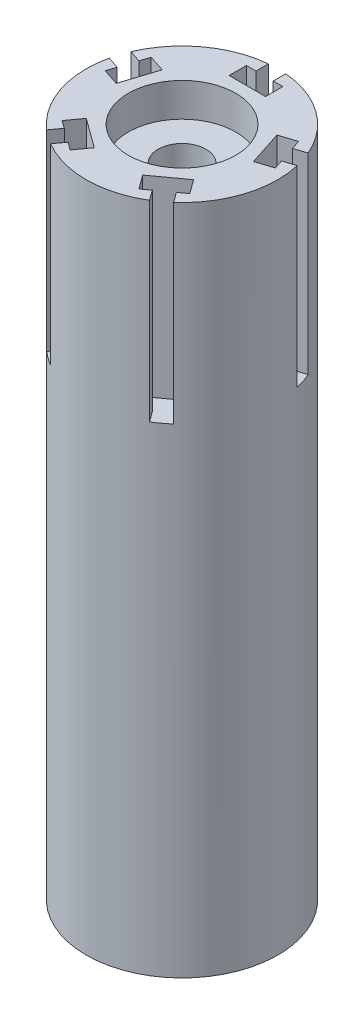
ISO-10303-21;
HEADER;
FILE_DESCRIPTION(('STEP AP214'),'2;1');
FILE_NAME('part.step','',(''),(''),'','','');
FILE_SCHEMA(('AUTOMOTIVE_DESIGN { 1 0 10303 214 1 1 1 1 }'));
ENDSEC;
DATA;
#1=APPLICATION_CONTEXT('core data for automotive mechanical design processes');
#2=APPLICATION_PROTOCOL_DEFINITION('international standard','automotive_design',2000,#1);
#3=PRODUCT_CONTEXT('',#1,'mechanical');
#4=PRODUCT('Part','Part','',(#3));
#5=PRODUCT_RELATED_PRODUCT_CATEGORY('part','',(#4));
#6=PRODUCT_DEFINITION_FORMATION('','',#4);
#7=PRODUCT_DEFINITION_CONTEXT('part definition',#1,'design');
#8=PRODUCT_DEFINITION('design','',#6,#7);
#9=PRODUCT_DEFINITION_SHAPE('','',#8);
#10=(LENGTH_UNIT() NAMED_UNIT(*) SI_UNIT(.MILLI.,.METRE.));
#11=(NAMED_UNIT(*) PLANE_ANGLE_UNIT() SI_UNIT($,.RADIAN.));
#12=(NAMED_UNIT(*) SI_UNIT($,.STERADIAN.) SOLID_ANGLE_UNIT());
#13=UNCERTAINTY_MEASURE_WITH_UNIT(LENGTH_MEASURE(1.E-05),#10,'distance_accuracy_value','');
#14=(GEOMETRIC_REPRESENTATION_CONTEXT(3) GLOBAL_UNCERTAINTY_ASSIGNED_CONTEXT((#13)) GLOBAL_UNIT_ASSIGNED_CONTEXT((#10,
#11,#12)) REPRESENTATION_CONTEXT('',''));
#15=CARTESIAN_POINT('',(0.,0.,0.));
#16=DIRECTION('',(0.,0.,1.));
#17=DIRECTION('',(1.,0.,0.));
#18=AXIS2_PLACEMENT_3D('',#15,#16,#17);
#19=CARTESIAN_POINT('',(0.,140.,0.));
#20=DIRECTION('',(0.,-1.,0.));
#21=DIRECTION('',(0.,0.,-1.));
#22=AXIS2_PLACEMENT_3D('',#19,#20,#21);
#23=CYLINDRICAL_SURFACE('',#22,5.);
#24=CARTESIAN_POINT('',(0.,7.00000000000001,0.));
#25=DIRECTION('',(0.,-1.,0.));
#26=DIRECTION('',(0.,0.,-1.));
#27=AXIS2_PLACEMENT_3D('',#24,#25,#26);
#28=CIRCLE('',#27,5.);
#29=CARTESIAN_POINT('',(0.,7.00000000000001,-5.));
#30=VERTEX_POINT('',#29);
#31=EDGE_CURVE('E575',#30,#30,#28,.T.);
#32=ORIENTED_EDGE('',*,*,#31,.T.);
#33=EDGE_LOOP('',(#32));
#34=FACE_BOUND('',#33,.T.);
#35=CARTESIAN_POINT('',(0.,133.,0.));
#36=DIRECTION('',(0.,1.,0.));
#37=DIRECTION('',(0.,0.,1.));
#38=AXIS2_PLACEMENT_3D('',#35,#36,#37);
#39=CIRCLE('',#38,5.);
#40=CARTESIAN_POINT('',(0.,133.,5.));
#41=VERTEX_POINT('',#40);
#42=EDGE_CURVE('E37',#41,#41,#39,.F.);
#43=ORIENTED_EDGE('',*,*,#42,.F.);
#44=EDGE_LOOP('',(#43));
#45=FACE_BOUND('',#44,.T.);
#46=ADVANCED_FACE('F33',(#34,#45),#23,.F.);
#47=CARTESIAN_POINT('',(0.,140.,0.));
#48=DIRECTION('',(0.,-1.,0.));
#49=DIRECTION('',(0.,0.,-1.));
#50=AXIS2_PLACEMENT_3D('',#47,#48,#49);
#51=CYLINDRICAL_SURFACE('',#50,20.);
#52=CARTESIAN_POINT('',(0.,100.,0.));
#53=DIRECTION('',(0.,1.,0.));
#54=DIRECTION('',(0.587785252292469,0.,-0.809016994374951));
#55=AXIS2_PLACEMENT_3D('',#52,#53,#54);
#56=CIRCLE('',#55,20.);
#57=CARTESIAN_POINT('',(-13.0884894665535,100.,15.1225475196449));
#58=VERTEX_POINT('',#57);
#59=CARTESIAN_POINT('',(-10.1654049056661,100.,17.2239525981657));
#60=VERTEX_POINT('',#59);
#61=EDGE_CURVE('E306',#58,#60,#56,.T.);
#62=ORIENTED_EDGE('',*,*,#61,.F.);
#63=DIRECTION('',(0.,1.,0.));
#64=VECTOR('',#63,1.);
#65=CARTESIAN_POINT('',(-13.0884894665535,100.,15.1225475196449));
#66=LINE('',#65,#64);
#67=CARTESIAN_POINT('',(-13.0884894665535,140.,15.1225475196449));
#68=VERTEX_POINT('',#67);
#69=EDGE_CURVE('E479',#58,#68,#66,.T.);
#70=ORIENTED_EDGE('',*,*,#69,.T.);
#71=CARTESIAN_POINT('',(0.,140.,0.));
#72=DIRECTION('',(0.,1.,0.));
#73=DIRECTION('',(0.,0.,1.));
#74=AXIS2_PLACEMENT_3D('',#71,#72,#73);
#75=CIRCLE('',#74,20.);
#76=CARTESIAN_POINT('',(-19.5222352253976,140.,-4.34538051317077));
#77=VERTEX_POINT('',#76);
#78=EDGE_CURVE('E42',#77,#68,#75,.T.);
#79=ORIENTED_EDGE('',*,*,#78,.F.);
#80=DIRECTION('',(0.,1.,0.));
#81=VECTOR('',#80,1.);
#82=CARTESIAN_POINT('',(-19.5222352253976,100.,-4.34538051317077));
#83=LINE('',#82,#81);
#84=CARTESIAN_POINT('',(-19.5222352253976,100.,-4.34538051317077));
#85=VERTEX_POINT('',#84);
#86=EDGE_CURVE('E474',#85,#77,#83,.T.);
#87=ORIENTED_EDGE('',*,*,#86,.F.);
#88=CARTESIAN_POINT('',(0.,100.,0.));
#89=DIRECTION('',(0.,1.,0.));
#90=DIRECTION('',(0.951056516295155,0.,0.309016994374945));
#91=AXIS2_PLACEMENT_3D('',#88,#89,#90);
#92=CIRCLE('',#91,20.);
#93=CARTESIAN_POINT('',(-18.4269630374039,100.,-7.77476901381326));
#94=VERTEX_POINT('',#93);
#95=EDGE_CURVE('E449',#94,#85,#92,.T.);
#96=ORIENTED_EDGE('',*,*,#95,.F.);
#97=DIRECTION('',(0.,1.,0.));
#98=VECTOR('',#97,1.);
#99=CARTESIAN_POINT('',(-18.4269630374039,100.,-7.77476901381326));
#100=LINE('',#99,#98);
#101=CARTESIAN_POINT('',(-18.4269630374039,140.,-7.77476901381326));
#102=VERTEX_POINT('',#101);
#103=EDGE_CURVE('E495',#94,#102,#100,.T.);
#104=ORIENTED_EDGE('',*,*,#103,.T.);
#105=CARTESIAN_POINT('',(-1.9,140.,-19.9095454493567));
#106=VERTEX_POINT('',#105);
#107=EDGE_CURVE('E11',#106,#102,#75,.T.);
#108=ORIENTED_EDGE('',*,*,#107,.F.);
#109=DIRECTION('',(0.,1.,0.));
#110=VECTOR('',#109,1.);
#111=CARTESIAN_POINT('',(-1.9,100.,-19.9095454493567));
#112=LINE('',#111,#110);
#113=CARTESIAN_POINT('',(-1.9,100.,-19.9095454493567));
#114=VERTEX_POINT('',#113);
#115=EDGE_CURVE('E537',#114,#106,#112,.T.);
#116=ORIENTED_EDGE('',*,*,#115,.F.);
#117=CARTESIAN_POINT('',(0.,100.,0.));
#118=DIRECTION('',(0.,1.,0.));
#119=DIRECTION('',(0.,0.,1.));
#120=AXIS2_PLACEMENT_3D('',#117,#118,#119);
#121=CIRCLE('',#120,20.);
#122=CARTESIAN_POINT('',(1.7,100.,-19.9276190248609));
#123=VERTEX_POINT('',#122);
#124=EDGE_CURVE('E512',#123,#114,#121,.T.);
#125=ORIENTED_EDGE('',*,*,#124,.F.);
#126=DIRECTION('',(0.,1.,0.));
#127=VECTOR('',#126,1.);
#128=CARTESIAN_POINT('',(1.7,100.,-19.9276190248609));
#129=LINE('',#128,#127);
#130=CARTESIAN_POINT('',(1.7,140.,-19.9276190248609));
#131=VERTEX_POINT('',#130);
#132=EDGE_CURVE('E557',#123,#131,#129,.T.);
#133=ORIENTED_EDGE('',*,*,#132,.T.);
#134=CARTESIAN_POINT('',(18.3479706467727,140.,-7.95939527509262));
#135=VERTEX_POINT('',#134);
#136=EDGE_CURVE('E44',#135,#131,#75,.T.);
#137=ORIENTED_EDGE('',*,*,#136,.F.);
#138=DIRECTION('',(0.,1.,0.));
#139=VECTOR('',#138,1.);
#140=CARTESIAN_POINT('',(18.3479706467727,100.,-7.95939527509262));
#141=LINE('',#140,#139);
#142=CARTESIAN_POINT('',(18.3479706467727,100.,-7.95939527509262));
#143=VERTEX_POINT('',#142);
#144=EDGE_CURVE('E51',#143,#135,#141,.T.);
#145=ORIENTED_EDGE('',*,*,#144,.F.);
#146=CARTESIAN_POINT('',(0.,100.,0.));
#147=DIRECTION('',(0.,1.,0.));
#148=DIRECTION('',(-0.95105651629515,0.,0.309016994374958));
#149=AXIS2_PLACEMENT_3D('',#146,#147,#148);
#150=CIRCLE('',#149,20.);
#151=CARTESIAN_POINT('',(19.4776208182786,100.,-4.54117685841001));
#152=VERTEX_POINT('',#151);
#153=EDGE_CURVE('E390',#152,#143,#150,.T.);
#154=ORIENTED_EDGE('',*,*,#153,.F.);
#155=DIRECTION('',(0.,1.,0.));
#156=VECTOR('',#155,1.);
#157=CARTESIAN_POINT('',(19.4776208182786,100.,-4.54117685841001));
#158=LINE('',#157,#156);
#159=CARTESIAN_POINT('',(19.4776208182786,140.,-4.54117685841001));
#160=VERTEX_POINT('',#159);
#161=EDGE_CURVE('E358',#152,#160,#158,.T.);
#162=ORIENTED_EDGE('',*,*,#161,.T.);
#163=CARTESIAN_POINT('',(13.2396694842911,140.,14.9903686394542));
#164=VERTEX_POINT('',#163);
#165=EDGE_CURVE('E661',#164,#160,#75,.T.);
#166=ORIENTED_EDGE('',*,*,#165,.F.);
#167=DIRECTION('',(0.,1.,0.));
#168=VECTOR('',#167,1.);
#169=CARTESIAN_POINT('',(13.2396694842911,100.,14.9903686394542));
#170=LINE('',#169,#168);
#171=CARTESIAN_POINT('',(13.2396694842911,100.,14.9903686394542));
#172=VERTEX_POINT('',#171);
#173=EDGE_CURVE('E59',#172,#164,#170,.T.);
#174=ORIENTED_EDGE('',*,*,#173,.F.);
#175=CARTESIAN_POINT('',(0.,100.,0.));
#176=DIRECTION('',(0.,1.,0.));
#177=DIRECTION('',(-0.58778525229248,0.,-0.809016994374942));
#178=AXIS2_PLACEMENT_3D('',#175,#176,#177);
#179=CIRCLE('',#178,20.);
#180=CARTESIAN_POINT('',(10.3378316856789,100.,17.1210173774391));
#181=VERTEX_POINT('',#180);
#182=EDGE_CURVE('E330',#181,#172,#179,.T.);
#183=ORIENTED_EDGE('',*,*,#182,.F.);
#184=DIRECTION('',(0.,1.,0.));
#185=VECTOR('',#184,1.);
#186=CARTESIAN_POINT('',(10.3378316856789,100.,17.1210173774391));
#187=LINE('',#186,#185);
#188=CARTESIAN_POINT('',(10.3378316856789,140.,17.1210173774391));
#189=VERTEX_POINT('',#188);
#190=EDGE_CURVE('E374',#181,#189,#187,.T.);
#191=ORIENTED_EDGE('',*,*,#190,.T.);
#192=CARTESIAN_POINT('',(-10.1654049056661,140.,17.2239525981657));
#193=VERTEX_POINT('',#192);
#194=EDGE_CURVE('E322',#193,#189,#75,.T.);
#195=ORIENTED_EDGE('',*,*,#194,.F.);
#196=DIRECTION('',(0.,1.,0.));
#197=VECTOR('',#196,1.);
#198=CARTESIAN_POINT('',(-10.1654049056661,100.,17.2239525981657));
#199=LINE('',#198,#197);
#200=EDGE_CURVE('E299',#60,#193,#199,.T.);
#201=ORIENTED_EDGE('',*,*,#200,.F.);
#202=EDGE_LOOP('',(#62,#70,#79,#87,#96,#104,#108,#116,#125,#133,#137,#145,#154,#162,#166,#174,
#183,#191,#195,#201));
#203=FACE_BOUND('',#202,.T.);
#204=CARTESIAN_POINT('',(0.,0.,0.));
#205=DIRECTION('',(0.,1.,0.));
#206=DIRECTION('',(0.,0.,1.));
#207=AXIS2_PLACEMENT_3D('',#204,#205,#206);
#208=CIRCLE('',#207,20.);
#209=CARTESIAN_POINT('',(0.,0.,20.));
#210=VERTEX_POINT('',#209);
#211=EDGE_CURVE('E560',#210,#210,#208,.T.);
#212=ORIENTED_EDGE('',*,*,#211,.T.);
#213=EDGE_LOOP('',(#212));
#214=FACE_BOUND('',#213,.T.);
#215=ADVANCED_FACE('F35',(#203,#214),#51,.T.);
#216=CARTESIAN_POINT('',(0.,140.,0.));
#217=DIRECTION('',(0.,1.,0.));
#218=DIRECTION('',(0.,0.,1.));
#219=AXIS2_PLACEMENT_3D('',#216,#217,#218);
#220=PLANE('',#219);
#221=CARTESIAN_POINT('',(0.,140.,0.));
#222=DIRECTION('',(0.,1.,0.));
#223=DIRECTION('',(0.,0.,1.));
#224=AXIS2_PLACEMENT_3D('',#221,#222,#223);
#225=CIRCLE('',#224,11.2);
#226=CARTESIAN_POINT('',(0.,140.,11.2));
#227=VERTEX_POINT('',#226);
#228=EDGE_CURVE('E587',#227,#227,#225,.T.);
#229=ORIENTED_EDGE('',*,*,#228,.F.);
#230=EDGE_LOOP('',(#229));
#231=FACE_BOUND('',#230,.T.);
#232=DIRECTION('',(-0.587785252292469,0.,0.809016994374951));
#233=VECTOR('',#232,1.);
#234=CARTESIAN_POINT('',(-13.0884894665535,140.,15.1225475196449));
#235=LINE('',#234,#233);
#236=CARTESIAN_POINT('',(-11.5496244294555,140.,13.004481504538));
#237=VERTEX_POINT('',#236);
#238=EDGE_CURVE('E316',#237,#68,#235,.T.);
#239=ORIENTED_EDGE('',*,*,#238,.F.);
#240=DIRECTION('',(0.809016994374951,0.,0.587785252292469));
#241=VECTOR('',#240,1.);
#242=CARTESIAN_POINT('',(-11.5496244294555,140.,13.004481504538));
#243=LINE('',#242,#241);
#244=CARTESIAN_POINT('',(-13.1676584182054,140.,11.828910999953));
#245=VERTEX_POINT('',#244);
#246=EDGE_CURVE('E620',#245,#237,#243,.T.);
#247=ORIENTED_EDGE('',*,*,#246,.F.);
#248=DIRECTION('',(-0.587785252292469,0.,0.809016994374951));
#249=VECTOR('',#248,1.);
#250=CARTESIAN_POINT('',(-13.1676584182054,140.,11.828910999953));
#251=LINE('',#250,#249);
#252=CARTESIAN_POINT('',(-11.0516315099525,140.,8.91644982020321));
#253=VERTEX_POINT('',#252);
#254=EDGE_CURVE('E617',#253,#245,#251,.T.);
#255=ORIENTED_EDGE('',*,*,#254,.F.);
#256=DIRECTION('',(-0.809016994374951,0.,-0.587785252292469));
#257=VECTOR('',#256,1.);
#258=CARTESIAN_POINT('',(-4.90310235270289,140.,13.383617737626));
#259=LINE('',#258,#257);
#260=CARTESIAN_POINT('',(-4.90310235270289,140.,13.383617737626));
#261=VERTEX_POINT('',#260);
#262=EDGE_CURVE('E614',#261,#253,#259,.T.);
#263=ORIENTED_EDGE('',*,*,#262,.F.);
#264=DIRECTION('',(0.587785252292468,0.,-0.809016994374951));
#265=VECTOR('',#264,1.);
#266=CARTESIAN_POINT('',(-7.01912926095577,140.,16.2960789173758));
#267=LINE('',#266,#265);
#268=CARTESIAN_POINT('',(-7.01912926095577,140.,16.2960789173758));
#269=VERTEX_POINT('',#268);
#270=EDGE_CURVE('E611',#269,#261,#267,.T.);
#271=ORIENTED_EDGE('',*,*,#270,.F.);
#272=DIRECTION('',(0.809016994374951,0.,0.587785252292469));
#273=VECTOR('',#272,1.);
#274=CARTESIAN_POINT('',(-7.01912926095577,140.,16.2960789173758));
#275=LINE('',#274,#273);
#276=CARTESIAN_POINT('',(-8.63716324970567,140.,15.1205084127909));
#277=VERTEX_POINT('',#276);
#278=EDGE_CURVE('E608',#277,#269,#275,.T.);
#279=ORIENTED_EDGE('',*,*,#278,.F.);
#280=DIRECTION('',(0.587785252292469,0.,-0.809016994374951));
#281=VECTOR('',#280,1.);
#282=CARTESIAN_POINT('',(-10.1654049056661,140.,17.2239525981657));
#283=LINE('',#282,#281);
#284=EDGE_CURVE('E376',#193,#277,#283,.T.);
#285=ORIENTED_EDGE('',*,*,#284,.F.);
#286=ORIENTED_EDGE('',*,*,#194,.T.);
#287=DIRECTION('',(0.58778525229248,0.,0.809016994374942));
#288=VECTOR('',#287,1.);
#289=CARTESIAN_POINT('',(10.3378316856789,140.,17.1210173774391));
#290=LINE('',#289,#288);
#291=CARTESIAN_POINT('',(8.79896664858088,140.,15.0029513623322));
#292=VERTEX_POINT('',#291);
#293=EDGE_CURVE('E334',#292,#189,#290,.T.);
#294=ORIENTED_EDGE('',*,*,#293,.F.);
#295=DIRECTION('',(0.809016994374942,0.,-0.58778525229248));
#296=VECTOR('',#295,1.);
#297=CARTESIAN_POINT('',(8.79896664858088,140.,15.0029513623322));
#298=LINE('',#297,#296);
#299=CARTESIAN_POINT('',(7.18093265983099,140.,16.1785218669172));
#300=VERTEX_POINT('',#299);
#301=EDGE_CURVE('E370',#300,#292,#298,.T.);
#302=ORIENTED_EDGE('',*,*,#301,.F.);
#303=DIRECTION('',(0.58778525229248,0.,0.809016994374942));
#304=VECTOR('',#303,1.);
#305=CARTESIAN_POINT('',(7.18093265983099,140.,16.1785218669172));
#306=LINE('',#305,#304);
#307=CARTESIAN_POINT('',(5.06490575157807,140.,13.2660606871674));
#308=VERTEX_POINT('',#307);
#309=EDGE_CURVE('E367',#308,#300,#306,.T.);
#310=ORIENTED_EDGE('',*,*,#309,.F.);
#311=DIRECTION('',(-0.809016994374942,0.,0.58778525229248));
#312=VECTOR('',#311,1.);
#313=CARTESIAN_POINT('',(11.2134349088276,140.,8.79889276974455));
#314=LINE('',#313,#312);
#315=CARTESIAN_POINT('',(11.2134349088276,140.,8.79889276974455));
#316=VERTEX_POINT('',#315);
#317=EDGE_CURVE('E364',#316,#308,#314,.T.);
#318=ORIENTED_EDGE('',*,*,#317,.F.);
#319=DIRECTION('',(-0.58778525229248,0.,-0.809016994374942));
#320=VECTOR('',#319,1.);
#321=CARTESIAN_POINT('',(13.3294618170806,140.,11.7113539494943));
#322=LINE('',#321,#320);
#323=CARTESIAN_POINT('',(13.3294618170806,140.,11.7113539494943));
#324=VERTEX_POINT('',#323);
#325=EDGE_CURVE('E361',#324,#316,#322,.T.);
#326=ORIENTED_EDGE('',*,*,#325,.F.);
#327=DIRECTION('',(0.809016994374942,0.,-0.58778525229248));
#328=VECTOR('',#327,1.);
#329=CARTESIAN_POINT('',(13.3294618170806,140.,11.7113539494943));
#330=LINE('',#329,#328);
#331=CARTESIAN_POINT('',(11.7114278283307,140.,12.8869244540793));
#332=VERTEX_POINT('',#331);
#333=EDGE_CURVE('E357',#332,#324,#330,.T.);
#334=ORIENTED_EDGE('',*,*,#333,.F.);
#335=DIRECTION('',(-0.58778525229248,0.,-0.809016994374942));
#336=VECTOR('',#335,1.);
#337=CARTESIAN_POINT('',(13.2396694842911,140.,14.9903686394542));
#338=LINE('',#337,#336);
#339=EDGE_CURVE('E355',#164,#332,#338,.T.);
#340=ORIENTED_EDGE('',*,*,#339,.F.);
#341=ORIENTED_EDGE('',*,*,#165,.T.);
#342=DIRECTION('',(0.95105651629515,0.,-0.309016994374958));
#343=VECTOR('',#342,1.);
#344=CARTESIAN_POINT('',(19.4776208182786,140.,-4.54117685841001));
#345=LINE('',#344,#343);
#346=CARTESIAN_POINT('',(16.9876848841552,140.,-3.73214763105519));
#347=VERTEX_POINT('',#346);
#348=EDGE_CURVE('E394',#347,#160,#345,.T.);
#349=ORIENTED_EDGE('',*,*,#348,.F.);
#350=DIRECTION('',(-0.309016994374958,0.,-0.95105651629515));
#351=VECTOR('',#350,1.);
#352=CARTESIAN_POINT('',(16.9876848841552,140.,-3.73214763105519));
#353=LINE('',#352,#351);
#354=CARTESIAN_POINT('',(17.6057188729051,140.,-1.83003459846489));
#355=VERTEX_POINT('',#354);
#356=EDGE_CURVE('E430',#355,#347,#353,.T.);
#357=ORIENTED_EDGE('',*,*,#356,.F.);
#358=DIRECTION('',(0.95105651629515,0.,-0.309016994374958));
#359=VECTOR('',#358,1.);
#360=CARTESIAN_POINT('',(17.6057188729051,140.,-1.83003459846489));
#361=LINE('',#360,#359);
#362=CARTESIAN_POINT('',(14.1819154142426,140.,-0.717573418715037));
#363=VERTEX_POINT('',#362);
#364=EDGE_CURVE('E427',#363,#355,#361,.T.);
#365=ORIENTED_EDGE('',*,*,#364,.F.);
#366=DIRECTION('',(0.309016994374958,0.,0.95105651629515));
#367=VECTOR('',#366,1.);
#368=CARTESIAN_POINT('',(11.8333862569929,140.,-7.94560294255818));
#369=LINE('',#368,#367);
#370=CARTESIAN_POINT('',(11.8333862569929,140.,-7.94560294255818));
#371=VERTEX_POINT('',#370);
#372=EDGE_CURVE('E424',#371,#363,#369,.T.);
#373=ORIENTED_EDGE('',*,*,#372,.F.);
#374=DIRECTION('',(-0.95105651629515,0.,0.309016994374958));
#375=VECTOR('',#374,1.);
#376=CARTESIAN_POINT('',(15.2571897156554,140.,-9.05806412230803));
#377=LINE('',#376,#375);
#378=CARTESIAN_POINT('',(15.2571897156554,140.,-9.05806412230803));
#379=VERTEX_POINT('',#378);
#380=EDGE_CURVE('E421',#379,#371,#377,.T.);
#381=ORIENTED_EDGE('',*,*,#380,.F.);
#382=DIRECTION('',(-0.309016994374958,0.,-0.95105651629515));
#383=VECTOR('',#382,1.);
#384=CARTESIAN_POINT('',(15.2571897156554,140.,-9.05806412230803));
#385=LINE('',#384,#383);
#386=CARTESIAN_POINT('',(15.8752237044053,140.,-7.15595108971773));
#387=VERTEX_POINT('',#386);
#388=EDGE_CURVE('E417',#387,#379,#385,.T.);
#389=ORIENTED_EDGE('',*,*,#388,.F.);
#390=DIRECTION('',(-0.95105651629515,0.,0.309016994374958));
#391=VECTOR('',#390,1.);
#392=CARTESIAN_POINT('',(18.3479706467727,140.,-7.95939527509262));
#393=LINE('',#392,#391);
#394=EDGE_CURVE('E415',#135,#387,#393,.T.);
#395=ORIENTED_EDGE('',*,*,#394,.F.);
#396=ORIENTED_EDGE('',*,*,#136,.T.);
#397=DIRECTION('',(0.,0.,-1.));
#398=VECTOR('',#397,1.);
#399=CARTESIAN_POINT('',(1.7,140.,-19.9276190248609));
#400=LINE('',#399,#398);
#401=CARTESIAN_POINT('',(1.7,140.,-17.3095454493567));
#402=VERTEX_POINT('',#401);
#403=EDGE_CURVE('E516',#402,#131,#400,.T.);
#404=ORIENTED_EDGE('',*,*,#403,.F.);
#405=DIRECTION('',(-1.,0.,0.));
#406=VECTOR('',#405,1.);
#407=CARTESIAN_POINT('',(1.7,140.,-17.3095454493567));
#408=LINE('',#407,#406);
#409=CARTESIAN_POINT('',(3.7,140.,-17.3095454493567));
#410=VERTEX_POINT('',#409);
#411=EDGE_CURVE('E552',#410,#402,#408,.T.);
#412=ORIENTED_EDGE('',*,*,#411,.F.);
#413=DIRECTION('',(0.,0.,-1.));
#414=VECTOR('',#413,1.);
#415=CARTESIAN_POINT('',(3.7,140.,-17.3095454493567));
#416=LINE('',#415,#414);
#417=CARTESIAN_POINT('',(3.7,140.,-13.7095454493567));
#418=VERTEX_POINT('',#417);
#419=EDGE_CURVE('E549',#418,#410,#416,.T.);
#420=ORIENTED_EDGE('',*,*,#419,.F.);
#421=DIRECTION('',(1.,0.,0.));
#422=VECTOR('',#421,1.);
#423=CARTESIAN_POINT('',(-3.9,140.,-13.7095454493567));
#424=LINE('',#423,#422);
#425=CARTESIAN_POINT('',(-3.9,140.,-13.7095454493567));
#426=VERTEX_POINT('',#425);
#427=EDGE_CURVE('E546',#426,#418,#424,.T.);
#428=ORIENTED_EDGE('',*,*,#427,.F.);
#429=DIRECTION('',(0.,0.,1.));
#430=VECTOR('',#429,1.);
#431=CARTESIAN_POINT('',(-3.9,140.,-17.3095454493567));
#432=LINE('',#431,#430);
#433=CARTESIAN_POINT('',(-3.9,140.,-17.3095454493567));
#434=VERTEX_POINT('',#433);
#435=EDGE_CURVE('E543',#434,#426,#432,.T.);
#436=ORIENTED_EDGE('',*,*,#435,.F.);
#437=DIRECTION('',(-1.,0.,0.));
#438=VECTOR('',#437,1.);
#439=CARTESIAN_POINT('',(-3.9,140.,-17.3095454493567));
#440=LINE('',#439,#438);
#441=CARTESIAN_POINT('',(-1.9,140.,-17.3095454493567));
#442=VERTEX_POINT('',#441);
#443=EDGE_CURVE('E540',#442,#434,#440,.T.);
#444=ORIENTED_EDGE('',*,*,#443,.F.);
#445=DIRECTION('',(0.,0.,1.));
#446=VECTOR('',#445,1.);
#447=CARTESIAN_POINT('',(-1.9,140.,-19.9095454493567));
#448=LINE('',#447,#446);
#449=EDGE_CURVE('E498',#106,#442,#448,.T.);
#450=ORIENTED_EDGE('',*,*,#449,.F.);
#451=ORIENTED_EDGE('',*,*,#107,.T.);
#452=DIRECTION('',(-0.951056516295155,0.,-0.309016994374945));
#453=VECTOR('',#452,1.);
#454=CARTESIAN_POINT('',(-18.4269630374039,140.,-7.77476901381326));
#455=LINE('',#454,#453);
#456=CARTESIAN_POINT('',(-15.9370271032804,140.,-6.96573978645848));
#457=VERTEX_POINT('',#456);
#458=EDGE_CURVE('E453',#457,#102,#455,.T.);
#459=ORIENTED_EDGE('',*,*,#458,.F.);
#460=DIRECTION('',(-0.309016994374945,0.,0.951056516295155));
#461=VECTOR('',#460,1.);
#462=CARTESIAN_POINT('',(-15.9370271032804,140.,-6.96573978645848));
#463=LINE('',#462,#461);
#464=CARTESIAN_POINT('',(-15.3189931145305,140.,-8.86785281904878));
#465=VERTEX_POINT('',#464);
#466=EDGE_CURVE('E491',#465,#457,#463,.T.);
#467=ORIENTED_EDGE('',*,*,#466,.F.);
#468=DIRECTION('',(-0.951056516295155,0.,-0.309016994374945));
#469=VECTOR('',#468,1.);
#470=CARTESIAN_POINT('',(-15.3189931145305,140.,-8.86785281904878));
#471=LINE('',#470,#469);
#472=CARTESIAN_POINT('',(-11.895189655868,140.,-7.75539163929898));
#473=VERTEX_POINT('',#472);
#474=EDGE_CURVE('E488',#473,#465,#471,.T.);
#475=ORIENTED_EDGE('',*,*,#474,.F.);
#476=DIRECTION('',(0.309016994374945,0.,-0.951056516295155));
#477=VECTOR('',#476,1.);
#478=CARTESIAN_POINT('',(-14.2437188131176,140.,-0.527362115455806));
#479=LINE('',#478,#477);
#480=CARTESIAN_POINT('',(-14.2437188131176,140.,-0.527362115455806));
#481=VERTEX_POINT('',#480);
#482=EDGE_CURVE('E485',#481,#473,#479,.T.);
#483=ORIENTED_EDGE('',*,*,#482,.F.);
#484=DIRECTION('',(0.951056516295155,0.,0.309016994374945));
#485=VECTOR('',#484,1.);
#486=CARTESIAN_POINT('',(-17.6675222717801,140.,-1.63982329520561));
#487=LINE('',#486,#485);
#488=CARTESIAN_POINT('',(-17.6675222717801,140.,-1.63982329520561));
#489=VERTEX_POINT('',#488);
#490=EDGE_CURVE('E482',#489,#481,#487,.T.);
#491=ORIENTED_EDGE('',*,*,#490,.F.);
#492=DIRECTION('',(-0.309016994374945,0.,0.951056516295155));
#493=VECTOR('',#492,1.);
#494=CARTESIAN_POINT('',(-17.6675222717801,140.,-1.63982329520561));
#495=LINE('',#494,#493);
#496=CARTESIAN_POINT('',(-17.0494882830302,140.,-3.54193632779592));
#497=VERTEX_POINT('',#496);
#498=EDGE_CURVE('E478',#497,#489,#495,.T.);
#499=ORIENTED_EDGE('',*,*,#498,.F.);
#500=DIRECTION('',(0.951056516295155,0.,0.309016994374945));
#501=VECTOR('',#500,1.);
#502=CARTESIAN_POINT('',(-19.5222352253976,140.,-4.34538051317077));
#503=LINE('',#502,#501);
#504=EDGE_CURVE('E475',#77,#497,#503,.T.);
#505=ORIENTED_EDGE('',*,*,#504,.F.);
#506=ORIENTED_EDGE('',*,*,#78,.T.);
#507=EDGE_LOOP('',(#239,#247,#255,#263,#271,#279,#285,#286,#294,#302,#310,#318,#326,#334,#340,
#341,#349,#357,#365,#373,#381,#389,#395,#396,#404,#412,#420,#428,#436,#444,#450,#451,#459,#467,
#475,#483,#491,#499,#505,#506));
#508=FACE_BOUND('',#507,.T.);
#509=ADVANCED_FACE('F642',(#231,#508),#220,.T.);
#510=CARTESIAN_POINT('',(0.,0.,0.));
#511=DIRECTION('',(0.,1.,0.));
#512=DIRECTION('',(0.,0.,1.));
#513=AXIS2_PLACEMENT_3D('',#510,#511,#512);
#514=PLANE('',#513);
#515=CARTESIAN_POINT('',(0.,0.,0.));
#516=DIRECTION('',(0.,-1.,0.));
#517=DIRECTION('',(0.,0.,-1.));
#518=AXIS2_PLACEMENT_3D('',#515,#516,#517);
#519=CIRCLE('',#518,11.2);
#520=CARTESIAN_POINT('',(0.,0.,-11.2));
#521=VERTEX_POINT('',#520);
#522=EDGE_CURVE('E577',#521,#521,#519,.T.);
#523=ORIENTED_EDGE('',*,*,#522,.F.);
#524=EDGE_LOOP('',(#523));
#525=FACE_BOUND('',#524,.T.);
#526=ORIENTED_EDGE('',*,*,#211,.F.);
#527=EDGE_LOOP('',(#526));
#528=FACE_BOUND('',#527,.T.);
#529=ADVANCED_FACE('F840',(#525,#528),#514,.F.);
#530=CARTESIAN_POINT('',(1.7,100.,-19.9276190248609));
#531=DIRECTION('',(1.,0.,0.));
#532=DIRECTION('',(0.,0.,-1.));
#533=AXIS2_PLACEMENT_3D('',#530,#531,#532);
#534=PLANE('',#533);
#535=ORIENTED_EDGE('',*,*,#403,.T.);
#536=ORIENTED_EDGE('',*,*,#132,.F.);
#537=DIRECTION('',(0.,0.,-1.));
#538=VECTOR('',#537,1.);
#539=CARTESIAN_POINT('',(1.7,100.,-19.9276190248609));
#540=LINE('',#539,#538);
#541=CARTESIAN_POINT('',(1.7,100.,-17.3095454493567));
#542=VERTEX_POINT('',#541);
#543=EDGE_CURVE('E534',#542,#123,#540,.T.);
#544=ORIENTED_EDGE('',*,*,#543,.F.);
#545=DIRECTION('',(0.,1.,0.));
#546=VECTOR('',#545,1.);
#547=CARTESIAN_POINT('',(1.7,100.,-17.3095454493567));
#548=LINE('',#547,#546);
#549=EDGE_CURVE('E561',#542,#402,#548,.T.);
#550=ORIENTED_EDGE('',*,*,#549,.T.);
#551=EDGE_LOOP('',(#535,#536,#544,#550));
#552=FACE_BOUND('',#551,.T.);
#553=ADVANCED_FACE('F671',(#552),#534,.F.);
#554=CARTESIAN_POINT('',(1.7,100.,-17.3095454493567));
#555=DIRECTION('',(0.,0.,-1.));
#556=DIRECTION('',(-1.,0.,0.));
#557=AXIS2_PLACEMENT_3D('',#554,#555,#556);
#558=PLANE('',#557);
#559=ORIENTED_EDGE('',*,*,#411,.T.);
#560=ORIENTED_EDGE('',*,*,#549,.F.);
#561=DIRECTION('',(-1.,0.,0.));
#562=VECTOR('',#561,1.);
#563=CARTESIAN_POINT('',(1.7,100.,-17.3095454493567));
#564=LINE('',#563,#562);
#565=CARTESIAN_POINT('',(3.7,100.,-17.3095454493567));
#566=VERTEX_POINT('',#565);
#567=EDGE_CURVE('E531',#566,#542,#564,.T.);
#568=ORIENTED_EDGE('',*,*,#567,.F.);
#569=DIRECTION('',(0.,1.,0.));
#570=VECTOR('',#569,1.);
#571=CARTESIAN_POINT('',(3.7,100.,-17.3095454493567));
#572=LINE('',#571,#570);
#573=EDGE_CURVE('E563',#566,#410,#572,.T.);
#574=ORIENTED_EDGE('',*,*,#573,.T.);
#575=EDGE_LOOP('',(#559,#560,#568,#574));
#576=FACE_BOUND('',#575,.T.);
#577=ADVANCED_FACE('F681',(#576),#558,.F.);
#578=CARTESIAN_POINT('',(3.7,100.,-17.3095454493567));
#579=DIRECTION('',(1.,0.,0.));
#580=DIRECTION('',(0.,0.,-1.));
#581=AXIS2_PLACEMENT_3D('',#578,#579,#580);
#582=PLANE('',#581);
#583=ORIENTED_EDGE('',*,*,#419,.T.);
#584=ORIENTED_EDGE('',*,*,#573,.F.);
#585=DIRECTION('',(0.,0.,-1.));
#586=VECTOR('',#585,1.);
#587=CARTESIAN_POINT('',(3.7,100.,-17.3095454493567));
#588=LINE('',#587,#586);
#589=CARTESIAN_POINT('',(3.7,100.,-13.7095454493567));
#590=VERTEX_POINT('',#589);
#591=EDGE_CURVE('E528',#590,#566,#588,.T.);
#592=ORIENTED_EDGE('',*,*,#591,.F.);
#593=DIRECTION('',(0.,1.,0.));
#594=VECTOR('',#593,1.);
#595=CARTESIAN_POINT('',(3.7,100.,-13.7095454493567));
#596=LINE('',#595,#594);
#597=EDGE_CURVE('E565',#590,#418,#596,.T.);
#598=ORIENTED_EDGE('',*,*,#597,.T.);
#599=EDGE_LOOP('',(#583,#584,#592,#598));
#600=FACE_BOUND('',#599,.T.);
#601=ADVANCED_FACE('F686',(#600),#582,.F.);
#602=CARTESIAN_POINT('',(-3.9,100.,-13.7095454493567));
#603=DIRECTION('',(0.,0.,1.));
#604=DIRECTION('',(1.,0.,0.));
#605=AXIS2_PLACEMENT_3D('',#602,#603,#604);
#606=PLANE('',#605);
#607=ORIENTED_EDGE('',*,*,#427,.T.);
#608=ORIENTED_EDGE('',*,*,#597,.F.);
#609=DIRECTION('',(1.,0.,0.));
#610=VECTOR('',#609,1.);
#611=CARTESIAN_POINT('',(-3.9,100.,-13.7095454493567));
#612=LINE('',#611,#610);
#613=CARTESIAN_POINT('',(-3.9,100.,-13.7095454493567));
#614=VERTEX_POINT('',#613);
#615=EDGE_CURVE('E525',#614,#590,#612,.T.);
#616=ORIENTED_EDGE('',*,*,#615,.F.);
#617=DIRECTION('',(0.,1.,0.));
#618=VECTOR('',#617,1.);
#619=CARTESIAN_POINT('',(-3.9,100.,-13.7095454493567));
#620=LINE('',#619,#618);
#621=EDGE_CURVE('E567',#614,#426,#620,.T.);
#622=ORIENTED_EDGE('',*,*,#621,.T.);
#623=EDGE_LOOP('',(#607,#608,#616,#622));
#624=FACE_BOUND('',#623,.T.);
#625=ADVANCED_FACE('F689',(#624),#606,.F.);
#626=CARTESIAN_POINT('',(-3.9,100.,-17.3095454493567));
#627=DIRECTION('',(-1.,0.,0.));
#628=DIRECTION('',(0.,0.,1.));
#629=AXIS2_PLACEMENT_3D('',#626,#627,#628);
#630=PLANE('',#629);
#631=ORIENTED_EDGE('',*,*,#435,.T.);
#632=ORIENTED_EDGE('',*,*,#621,.F.);
#633=DIRECTION('',(0.,0.,1.));
#634=VECTOR('',#633,1.);
#635=CARTESIAN_POINT('',(-3.9,100.,-17.3095454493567));
#636=LINE('',#635,#634);
#637=CARTESIAN_POINT('',(-3.9,100.,-17.3095454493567));
#638=VERTEX_POINT('',#637);
#639=EDGE_CURVE('E522',#638,#614,#636,.T.);
#640=ORIENTED_EDGE('',*,*,#639,.F.);
#641=DIRECTION('',(0.,1.,0.));
#642=VECTOR('',#641,1.);
#643=CARTESIAN_POINT('',(-3.9,100.,-17.3095454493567));
#644=LINE('',#643,#642);
#645=EDGE_CURVE('E569',#638,#434,#644,.T.);
#646=ORIENTED_EDGE('',*,*,#645,.T.);
#647=EDGE_LOOP('',(#631,#632,#640,#646));
#648=FACE_BOUND('',#647,.T.);
#649=ADVANCED_FACE('F692',(#648),#630,.F.);
#650=CARTESIAN_POINT('',(-3.9,100.,-17.3095454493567));
#651=DIRECTION('',(0.,0.,-1.));
#652=DIRECTION('',(-1.,0.,0.));
#653=AXIS2_PLACEMENT_3D('',#650,#651,#652);
#654=PLANE('',#653);
#655=ORIENTED_EDGE('',*,*,#443,.T.);
#656=ORIENTED_EDGE('',*,*,#645,.F.);
#657=DIRECTION('',(-1.,0.,0.));
#658=VECTOR('',#657,1.);
#659=CARTESIAN_POINT('',(-3.9,100.,-17.3095454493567));
#660=LINE('',#659,#658);
#661=CARTESIAN_POINT('',(-1.9,100.,-17.3095454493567));
#662=VERTEX_POINT('',#661);
#663=EDGE_CURVE('E519',#662,#638,#660,.T.);
#664=ORIENTED_EDGE('',*,*,#663,.F.);
#665=DIRECTION('',(0.,1.,0.));
#666=VECTOR('',#665,1.);
#667=CARTESIAN_POINT('',(-1.9,100.,-17.3095454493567));
#668=LINE('',#667,#666);
#669=EDGE_CURVE('E571',#662,#442,#668,.T.);
#670=ORIENTED_EDGE('',*,*,#669,.T.);
#671=EDGE_LOOP('',(#655,#656,#664,#670));
#672=FACE_BOUND('',#671,.T.);
#673=ADVANCED_FACE('F696',(#672),#654,.F.);
#674=CARTESIAN_POINT('',(-1.9,100.,-19.9095454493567));
#675=DIRECTION('',(-1.,0.,0.));
#676=DIRECTION('',(0.,0.,1.));
#677=AXIS2_PLACEMENT_3D('',#674,#675,#676);
#678=PLANE('',#677);
#679=ORIENTED_EDGE('',*,*,#449,.T.);
#680=ORIENTED_EDGE('',*,*,#669,.F.);
#681=DIRECTION('',(0.,0.,1.));
#682=VECTOR('',#681,1.);
#683=CARTESIAN_POINT('',(-1.9,100.,-19.9095454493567));
#684=LINE('',#683,#682);
#685=EDGE_CURVE('E515',#114,#662,#684,.T.);
#686=ORIENTED_EDGE('',*,*,#685,.F.);
#687=ORIENTED_EDGE('',*,*,#115,.T.);
#688=EDGE_LOOP('',(#679,#680,#686,#687));
#689=FACE_BOUND('',#688,.T.);
#690=ADVANCED_FACE('F699',(#689),#678,.F.);
#691=CARTESIAN_POINT('',(0.,100.,0.));
#692=DIRECTION('',(0.,1.,0.));
#693=DIRECTION('',(0.,0.,1.));
#694=AXIS2_PLACEMENT_3D('',#691,#692,#693);
#695=PLANE('',#694);
#696=ORIENTED_EDGE('',*,*,#124,.T.);
#697=ORIENTED_EDGE('',*,*,#685,.T.);
#698=ORIENTED_EDGE('',*,*,#663,.T.);
#699=ORIENTED_EDGE('',*,*,#639,.T.);
#700=ORIENTED_EDGE('',*,*,#615,.T.);
#701=ORIENTED_EDGE('',*,*,#591,.T.);
#702=ORIENTED_EDGE('',*,*,#567,.T.);
#703=ORIENTED_EDGE('',*,*,#543,.T.);
#704=EDGE_LOOP('',(#696,#697,#698,#699,#700,#701,#702,#703));
#705=FACE_BOUND('',#704,.T.);
#706=ADVANCED_FACE('F677',(#705),#695,.T.);
#707=CARTESIAN_POINT('',(-18.4269630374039,100.,-7.77476901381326));
#708=DIRECTION('',(0.309016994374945,0.,-0.951056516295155));
#709=DIRECTION('',(-0.951056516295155,0.,-0.309016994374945));
#710=AXIS2_PLACEMENT_3D('',#707,#708,#709);
#711=PLANE('',#710);
#712=ORIENTED_EDGE('',*,*,#458,.T.);
#713=ORIENTED_EDGE('',*,*,#103,.F.);
#714=DIRECTION('',(-0.951056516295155,0.,-0.309016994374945));
#715=VECTOR('',#714,1.);
#716=CARTESIAN_POINT('',(-18.4269630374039,100.,-7.77476901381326));
#717=LINE('',#716,#715);
#718=CARTESIAN_POINT('',(-15.9370271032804,100.,-6.96573978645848));
#719=VERTEX_POINT('',#718);
#720=EDGE_CURVE('E471',#719,#94,#717,.T.);
#721=ORIENTED_EDGE('',*,*,#720,.F.);
#722=DIRECTION('',(0.,1.,0.));
#723=VECTOR('',#722,1.);
#724=CARTESIAN_POINT('',(-15.9370271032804,100.,-6.96573978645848));
#725=LINE('',#724,#723);
#726=EDGE_CURVE('E499',#719,#457,#725,.T.);
#727=ORIENTED_EDGE('',*,*,#726,.T.);
#728=EDGE_LOOP('',(#712,#713,#721,#727));
#729=FACE_BOUND('',#728,.T.);
#730=ADVANCED_FACE('F706',(#729),#711,.F.);
#731=CARTESIAN_POINT('',(-15.9370271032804,100.,-6.96573978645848));
#732=DIRECTION('',(-0.951056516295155,0.,-0.309016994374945));
#733=DIRECTION('',(-0.309016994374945,0.,0.951056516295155));
#734=AXIS2_PLACEMENT_3D('',#731,#732,#733);
#735=PLANE('',#734);
#736=ORIENTED_EDGE('',*,*,#466,.T.);
#737=ORIENTED_EDGE('',*,*,#726,.F.);
#738=DIRECTION('',(-0.309016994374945,0.,0.951056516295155));
#739=VECTOR('',#738,1.);
#740=CARTESIAN_POINT('',(-15.9370271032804,100.,-6.96573978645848));
#741=LINE('',#740,#739);
#742=CARTESIAN_POINT('',(-15.3189931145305,100.,-8.86785281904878));
#743=VERTEX_POINT('',#742);
#744=EDGE_CURVE('E468',#743,#719,#741,.T.);
#745=ORIENTED_EDGE('',*,*,#744,.F.);
#746=DIRECTION('',(0.,1.,0.));
#747=VECTOR('',#746,1.);
#748=CARTESIAN_POINT('',(-15.3189931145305,100.,-8.86785281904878));
#749=LINE('',#748,#747);
#750=EDGE_CURVE('E501',#743,#465,#749,.T.);
#751=ORIENTED_EDGE('',*,*,#750,.T.);
#752=EDGE_LOOP('',(#736,#737,#745,#751));
#753=FACE_BOUND('',#752,.T.);
#754=ADVANCED_FACE('F814',(#753),#735,.F.);
#755=CARTESIAN_POINT('',(-15.3189931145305,100.,-8.86785281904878));
#756=DIRECTION('',(0.309016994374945,0.,-0.951056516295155));
#757=DIRECTION('',(-0.951056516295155,0.,-0.309016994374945));
#758=AXIS2_PLACEMENT_3D('',#755,#756,#757);
#759=PLANE('',#758);
#760=ORIENTED_EDGE('',*,*,#474,.T.);
#761=ORIENTED_EDGE('',*,*,#750,.F.);
#762=DIRECTION('',(-0.951056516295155,0.,-0.309016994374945));
#763=VECTOR('',#762,1.);
#764=CARTESIAN_POINT('',(-15.3189931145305,100.,-8.86785281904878));
#765=LINE('',#764,#763);
#766=CARTESIAN_POINT('',(-11.895189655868,100.,-7.75539163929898));
#767=VERTEX_POINT('',#766);
#768=EDGE_CURVE('E465',#767,#743,#765,.T.);
#769=ORIENTED_EDGE('',*,*,#768,.F.);
#770=DIRECTION('',(0.,1.,0.));
#771=VECTOR('',#770,1.);
#772=CARTESIAN_POINT('',(-11.895189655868,100.,-7.75539163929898));
#773=LINE('',#772,#771);
#774=EDGE_CURVE('E503',#767,#473,#773,.T.);
#775=ORIENTED_EDGE('',*,*,#774,.T.);
#776=EDGE_LOOP('',(#760,#761,#769,#775));
#777=FACE_BOUND('',#776,.T.);
#778=ADVANCED_FACE('F818',(#777),#759,.F.);
#779=CARTESIAN_POINT('',(-14.2437188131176,100.,-0.527362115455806));
#780=DIRECTION('',(0.951056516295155,0.,0.309016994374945));
#781=DIRECTION('',(0.309016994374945,0.,-0.951056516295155));
#782=AXIS2_PLACEMENT_3D('',#779,#780,#781);
#783=PLANE('',#782);
#784=ORIENTED_EDGE('',*,*,#482,.T.);
#785=ORIENTED_EDGE('',*,*,#774,.F.);
#786=DIRECTION('',(0.309016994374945,0.,-0.951056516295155));
#787=VECTOR('',#786,1.);
#788=CARTESIAN_POINT('',(-14.2437188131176,100.,-0.527362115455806));
#789=LINE('',#788,#787);
#790=CARTESIAN_POINT('',(-14.2437188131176,100.,-0.527362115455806));
#791=VERTEX_POINT('',#790);
#792=EDGE_CURVE('E462',#791,#767,#789,.T.);
#793=ORIENTED_EDGE('',*,*,#792,.F.);
#794=DIRECTION('',(0.,1.,0.));
#795=VECTOR('',#794,1.);
#796=CARTESIAN_POINT('',(-14.2437188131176,100.,-0.527362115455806));
#797=LINE('',#796,#795);
#798=EDGE_CURVE('E505',#791,#481,#797,.T.);
#799=ORIENTED_EDGE('',*,*,#798,.T.);
#800=EDGE_LOOP('',(#784,#785,#793,#799));
#801=FACE_BOUND('',#800,.T.);
#802=ADVANCED_FACE('F822',(#801),#783,.F.);
#803=CARTESIAN_POINT('',(-17.6675222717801,100.,-1.63982329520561));
#804=DIRECTION('',(-0.309016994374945,0.,0.951056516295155));
#805=DIRECTION('',(0.951056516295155,0.,0.309016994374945));
#806=AXIS2_PLACEMENT_3D('',#803,#804,#805);
#807=PLANE('',#806);
#808=ORIENTED_EDGE('',*,*,#490,.T.);
#809=ORIENTED_EDGE('',*,*,#798,.F.);
#810=DIRECTION('',(0.951056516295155,0.,0.309016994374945));
#811=VECTOR('',#810,1.);
#812=CARTESIAN_POINT('',(-17.6675222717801,100.,-1.63982329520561));
#813=LINE('',#812,#811);
#814=CARTESIAN_POINT('',(-17.6675222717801,100.,-1.63982329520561));
#815=VERTEX_POINT('',#814);
#816=EDGE_CURVE('E459',#815,#791,#813,.T.);
#817=ORIENTED_EDGE('',*,*,#816,.F.);
#818=DIRECTION('',(0.,1.,0.));
#819=VECTOR('',#818,1.);
#820=CARTESIAN_POINT('',(-17.6675222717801,100.,-1.63982329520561));
#821=LINE('',#820,#819);
#822=EDGE_CURVE('E507',#815,#489,#821,.T.);
#823=ORIENTED_EDGE('',*,*,#822,.T.);
#824=EDGE_LOOP('',(#808,#809,#817,#823));
#825=FACE_BOUND('',#824,.T.);
#826=ADVANCED_FACE('F826',(#825),#807,.F.);
#827=CARTESIAN_POINT('',(-17.6675222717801,100.,-1.63982329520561));
#828=DIRECTION('',(-0.951056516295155,0.,-0.309016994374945));
#829=DIRECTION('',(-0.309016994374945,0.,0.951056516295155));
#830=AXIS2_PLACEMENT_3D('',#827,#828,#829);
#831=PLANE('',#830);
#832=ORIENTED_EDGE('',*,*,#498,.T.);
#833=ORIENTED_EDGE('',*,*,#822,.F.);
#834=DIRECTION('',(-0.309016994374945,0.,0.951056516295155));
#835=VECTOR('',#834,1.);
#836=CARTESIAN_POINT('',(-17.6675222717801,100.,-1.63982329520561));
#837=LINE('',#836,#835);
#838=CARTESIAN_POINT('',(-17.0494882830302,100.,-3.54193632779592));
#839=VERTEX_POINT('',#838);
#840=EDGE_CURVE('E456',#839,#815,#837,.T.);
#841=ORIENTED_EDGE('',*,*,#840,.F.);
#842=DIRECTION('',(0.,1.,0.));
#843=VECTOR('',#842,1.);
#844=CARTESIAN_POINT('',(-17.0494882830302,100.,-3.54193632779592));
#845=LINE('',#844,#843);
#846=EDGE_CURVE('E509',#839,#497,#845,.T.);
#847=ORIENTED_EDGE('',*,*,#846,.T.);
#848=EDGE_LOOP('',(#832,#833,#841,#847));
#849=FACE_BOUND('',#848,.T.);
#850=ADVANCED_FACE('F830',(#849),#831,.F.);
#851=CARTESIAN_POINT('',(-19.5222352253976,100.,-4.34538051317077));
#852=DIRECTION('',(-0.309016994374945,0.,0.951056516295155));
#853=DIRECTION('',(0.951056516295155,0.,0.309016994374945));
#854=AXIS2_PLACEMENT_3D('',#851,#852,#853);
#855=PLANE('',#854);
#856=ORIENTED_EDGE('',*,*,#504,.T.);
#857=ORIENTED_EDGE('',*,*,#846,.F.);
#858=DIRECTION('',(0.951056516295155,0.,0.309016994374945));
#859=VECTOR('',#858,1.);
#860=CARTESIAN_POINT('',(-19.5222352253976,100.,-4.34538051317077));
#861=LINE('',#860,#859);
#862=EDGE_CURVE('E452',#85,#839,#861,.T.);
#863=ORIENTED_EDGE('',*,*,#862,.F.);
#864=ORIENTED_EDGE('',*,*,#86,.T.);
#865=EDGE_LOOP('',(#856,#857,#863,#864));
#866=FACE_BOUND('',#865,.T.);
#867=ADVANCED_FACE('F810',(#866),#855,.F.);
#868=CARTESIAN_POINT('',(0.,100.,0.));
#869=DIRECTION('',(0.,1.,0.));
#870=DIRECTION('',(0.951056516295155,0.,0.309016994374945));
#871=AXIS2_PLACEMENT_3D('',#868,#869,#870);
#872=PLANE('',#871);
#873=ORIENTED_EDGE('',*,*,#95,.T.);
#874=ORIENTED_EDGE('',*,*,#862,.T.);
#875=ORIENTED_EDGE('',*,*,#840,.T.);
#876=ORIENTED_EDGE('',*,*,#816,.T.);
#877=ORIENTED_EDGE('',*,*,#792,.T.);
#878=ORIENTED_EDGE('',*,*,#768,.T.);
#879=ORIENTED_EDGE('',*,*,#744,.T.);
#880=ORIENTED_EDGE('',*,*,#720,.T.);
#881=EDGE_LOOP('',(#873,#874,#875,#876,#877,#878,#879,#880));
#882=FACE_BOUND('',#881,.T.);
#883=ADVANCED_FACE('F785',(#882),#872,.T.);
#884=CARTESIAN_POINT('',(19.4776208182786,100.,-4.54117685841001));
#885=DIRECTION('',(0.309016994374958,0.,0.95105651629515));
#886=DIRECTION('',(0.95105651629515,0.,-0.309016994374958));
#887=AXIS2_PLACEMENT_3D('',#884,#885,#886);
#888=PLANE('',#887);
#889=ORIENTED_EDGE('',*,*,#348,.T.);
#890=ORIENTED_EDGE('',*,*,#161,.F.);
#891=DIRECTION('',(0.95105651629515,0.,-0.309016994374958));
#892=VECTOR('',#891,1.);
#893=CARTESIAN_POINT('',(19.4776208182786,100.,-4.54117685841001));
#894=LINE('',#893,#892);
#895=CARTESIAN_POINT('',(16.9876848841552,100.,-3.73214763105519));
#896=VERTEX_POINT('',#895);
#897=EDGE_CURVE('E412',#896,#152,#894,.T.);
#898=ORIENTED_EDGE('',*,*,#897,.F.);
#899=DIRECTION('',(0.,1.,0.));
#900=VECTOR('',#899,1.);
#901=CARTESIAN_POINT('',(16.9876848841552,100.,-3.73214763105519));
#902=LINE('',#901,#900);
#903=EDGE_CURVE('E436',#896,#347,#902,.T.);
#904=ORIENTED_EDGE('',*,*,#903,.T.);
#905=EDGE_LOOP('',(#889,#890,#898,#904));
#906=FACE_BOUND('',#905,.T.);
#907=ADVANCED_FACE('F781',(#906),#888,.F.);
#908=CARTESIAN_POINT('',(16.9876848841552,100.,-3.73214763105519));
#909=DIRECTION('',(0.95105651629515,0.,-0.309016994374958));
#910=DIRECTION('',(-0.309016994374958,0.,-0.95105651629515));
#911=AXIS2_PLACEMENT_3D('',#908,#909,#910);
#912=PLANE('',#911);
#913=ORIENTED_EDGE('',*,*,#356,.T.);
#914=ORIENTED_EDGE('',*,*,#903,.F.);
#915=DIRECTION('',(-0.309016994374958,0.,-0.95105651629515));
#916=VECTOR('',#915,1.);
#917=CARTESIAN_POINT('',(16.9876848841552,100.,-3.73214763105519));
#918=LINE('',#917,#916);
#919=CARTESIAN_POINT('',(17.6057188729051,100.,-1.83003459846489));
#920=VERTEX_POINT('',#919);
#921=EDGE_CURVE('E409',#920,#896,#918,.T.);
#922=ORIENTED_EDGE('',*,*,#921,.F.);
#923=DIRECTION('',(0.,1.,0.));
#924=VECTOR('',#923,1.);
#925=CARTESIAN_POINT('',(17.6057188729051,100.,-1.83003459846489));
#926=LINE('',#925,#924);
#927=EDGE_CURVE('E438',#920,#355,#926,.T.);
#928=ORIENTED_EDGE('',*,*,#927,.T.);
#929=EDGE_LOOP('',(#913,#914,#922,#928));
#930=FACE_BOUND('',#929,.T.);
#931=ADVANCED_FACE('F784',(#930),#912,.F.);
#932=CARTESIAN_POINT('',(17.6057188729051,100.,-1.83003459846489));
#933=DIRECTION('',(0.309016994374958,0.,0.95105651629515));
#934=DIRECTION('',(0.95105651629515,0.,-0.309016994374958));
#935=AXIS2_PLACEMENT_3D('',#932,#933,#934);
#936=PLANE('',#935);
#937=ORIENTED_EDGE('',*,*,#364,.T.);
#938=ORIENTED_EDGE('',*,*,#927,.F.);
#939=DIRECTION('',(0.95105651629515,0.,-0.309016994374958));
#940=VECTOR('',#939,1.);
#941=CARTESIAN_POINT('',(17.6057188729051,100.,-1.83003459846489));
#942=LINE('',#941,#940);
#943=CARTESIAN_POINT('',(14.1819154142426,100.,-0.717573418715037));
#944=VERTEX_POINT('',#943);
#945=EDGE_CURVE('E406',#944,#920,#942,.T.);
#946=ORIENTED_EDGE('',*,*,#945,.F.);
#947=DIRECTION('',(0.,1.,0.));
#948=VECTOR('',#947,1.);
#949=CARTESIAN_POINT('',(14.1819154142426,100.,-0.717573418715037));
#950=LINE('',#949,#948);
#951=EDGE_CURVE('E440',#944,#363,#950,.T.);
#952=ORIENTED_EDGE('',*,*,#951,.T.);
#953=EDGE_LOOP('',(#937,#938,#946,#952));
#954=FACE_BOUND('',#953,.T.);
#955=ADVANCED_FACE('F789',(#954),#936,.F.);
#956=CARTESIAN_POINT('',(11.8333862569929,100.,-7.94560294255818));
#957=DIRECTION('',(-0.95105651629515,0.,0.309016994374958));
#958=DIRECTION('',(0.309016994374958,0.,0.95105651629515));
#959=AXIS2_PLACEMENT_3D('',#956,#957,#958);
#960=PLANE('',#959);
#961=ORIENTED_EDGE('',*,*,#372,.T.);
#962=ORIENTED_EDGE('',*,*,#951,.F.);
#963=DIRECTION('',(0.309016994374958,0.,0.95105651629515));
#964=VECTOR('',#963,1.);
#965=CARTESIAN_POINT('',(11.8333862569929,100.,-7.94560294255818));
#966=LINE('',#965,#964);
#967=CARTESIAN_POINT('',(11.8333862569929,100.,-7.94560294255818));
#968=VERTEX_POINT('',#967);
#969=EDGE_CURVE('E403',#968,#944,#966,.T.);
#970=ORIENTED_EDGE('',*,*,#969,.F.);
#971=DIRECTION('',(0.,1.,0.));
#972=VECTOR('',#971,1.);
#973=CARTESIAN_POINT('',(11.8333862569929,100.,-7.94560294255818));
#974=LINE('',#973,#972);
#975=EDGE_CURVE('E442',#968,#371,#974,.T.);
#976=ORIENTED_EDGE('',*,*,#975,.T.);
#977=EDGE_LOOP('',(#961,#962,#970,#976));
#978=FACE_BOUND('',#977,.T.);
#979=ADVANCED_FACE('F793',(#978),#960,.F.);
#980=CARTESIAN_POINT('',(15.2571897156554,100.,-9.05806412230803));
#981=DIRECTION('',(-0.309016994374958,0.,-0.95105651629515));
#982=DIRECTION('',(-0.95105651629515,0.,0.309016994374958));
#983=AXIS2_PLACEMENT_3D('',#980,#981,#982);
#984=PLANE('',#983);
#985=ORIENTED_EDGE('',*,*,#380,.T.);
#986=ORIENTED_EDGE('',*,*,#975,.F.);
#987=DIRECTION('',(-0.95105651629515,0.,0.309016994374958));
#988=VECTOR('',#987,1.);
#989=CARTESIAN_POINT('',(15.2571897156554,100.,-9.05806412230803));
#990=LINE('',#989,#988);
#991=CARTESIAN_POINT('',(15.2571897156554,100.,-9.05806412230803));
#992=VERTEX_POINT('',#991);
#993=EDGE_CURVE('E400',#992,#968,#990,.T.);
#994=ORIENTED_EDGE('',*,*,#993,.F.);
#995=DIRECTION('',(0.,1.,0.));
#996=VECTOR('',#995,1.);
#997=CARTESIAN_POINT('',(15.2571897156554,100.,-9.05806412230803));
#998=LINE('',#997,#996);
#999=EDGE_CURVE('E444',#992,#379,#998,.T.);
#1000=ORIENTED_EDGE('',*,*,#999,.T.);
#1001=EDGE_LOOP('',(#985,#986,#994,#1000));
#1002=FACE_BOUND('',#1001,.T.);
#1003=ADVANCED_FACE('F797',(#1002),#984,.F.);
#1004=CARTESIAN_POINT('',(15.2571897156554,100.,-9.05806412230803));
#1005=DIRECTION('',(0.95105651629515,0.,-0.309016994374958));
#1006=DIRECTION('',(-0.309016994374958,0.,-0.95105651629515));
#1007=AXIS2_PLACEMENT_3D('',#1004,#1005,#1006);
#1008=PLANE('',#1007);
#1009=ORIENTED_EDGE('',*,*,#388,.T.);
#1010=ORIENTED_EDGE('',*,*,#999,.F.);
#1011=DIRECTION('',(-0.309016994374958,0.,-0.95105651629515));
#1012=VECTOR('',#1011,1.);
#1013=CARTESIAN_POINT('',(15.2571897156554,100.,-9.05806412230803));
#1014=LINE('',#1013,#1012);
#1015=CARTESIAN_POINT('',(15.8752237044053,100.,-7.15595108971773));
#1016=VERTEX_POINT('',#1015);
#1017=EDGE_CURVE('E397',#1016,#992,#1014,.T.);
#1018=ORIENTED_EDGE('',*,*,#1017,.F.);
#1019=DIRECTION('',(0.,1.,0.));
#1020=VECTOR('',#1019,1.);
#1021=CARTESIAN_POINT('',(15.8752237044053,100.,-7.15595108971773));
#1022=LINE('',#1021,#1020);
#1023=EDGE_CURVE('E446',#1016,#387,#1022,.T.);
#1024=ORIENTED_EDGE('',*,*,#1023,.T.);
#1025=EDGE_LOOP('',(#1009,#1010,#1018,#1024));
#1026=FACE_BOUND('',#1025,.T.);
#1027=ADVANCED_FACE('F801',(#1026),#1008,.F.);
#1028=CARTESIAN_POINT('',(18.3479706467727,100.,-7.95939527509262));
#1029=DIRECTION('',(-0.309016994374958,0.,-0.95105651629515));
#1030=DIRECTION('',(-0.95105651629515,0.,0.309016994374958));
#1031=AXIS2_PLACEMENT_3D('',#1028,#1029,#1030);
#1032=PLANE('',#1031);
#1033=ORIENTED_EDGE('',*,*,#394,.T.);
#1034=ORIENTED_EDGE('',*,*,#1023,.F.);
#1035=DIRECTION('',(-0.95105651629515,0.,0.309016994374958));
#1036=VECTOR('',#1035,1.);
#1037=CARTESIAN_POINT('',(18.3479706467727,100.,-7.95939527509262));
#1038=LINE('',#1037,#1036);
#1039=EDGE_CURVE('E393',#143,#1016,#1038,.T.);
#1040=ORIENTED_EDGE('',*,*,#1039,.F.);
#1041=ORIENTED_EDGE('',*,*,#144,.T.);
#1042=EDGE_LOOP('',(#1033,#1034,#1040,#1041));
#1043=FACE_BOUND('',#1042,.T.);
#1044=ADVANCED_FACE('F779',(#1043),#1032,.F.);
#1045=CARTESIAN_POINT('',(0.,100.,0.));
#1046=DIRECTION('',(0.,1.,0.));
#1047=DIRECTION('',(-0.95105651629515,0.,0.309016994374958));
#1048=AXIS2_PLACEMENT_3D('',#1045,#1046,#1047);
#1049=PLANE('',#1048);
#1050=ORIENTED_EDGE('',*,*,#153,.T.);
#1051=ORIENTED_EDGE('',*,*,#1039,.T.);
#1052=ORIENTED_EDGE('',*,*,#1017,.T.);
#1053=ORIENTED_EDGE('',*,*,#993,.T.);
#1054=ORIENTED_EDGE('',*,*,#969,.T.);
#1055=ORIENTED_EDGE('',*,*,#945,.T.);
#1056=ORIENTED_EDGE('',*,*,#921,.T.);
#1057=ORIENTED_EDGE('',*,*,#897,.T.);
#1058=EDGE_LOOP('',(#1050,#1051,#1052,#1053,#1054,#1055,#1056,#1057));
#1059=FACE_BOUND('',#1058,.T.);
#1060=ADVANCED_FACE('F754',(#1059),#1049,.T.);
#1061=CARTESIAN_POINT('',(10.3378316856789,100.,17.1210173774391));
#1062=DIRECTION('',(-0.809016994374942,0.,0.58778525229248));
#1063=DIRECTION('',(0.58778525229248,0.,0.809016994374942));
#1064=AXIS2_PLACEMENT_3D('',#1061,#1062,#1063);
#1065=PLANE('',#1064);
#1066=ORIENTED_EDGE('',*,*,#293,.T.);
#1067=ORIENTED_EDGE('',*,*,#190,.F.);
#1068=DIRECTION('',(0.58778525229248,0.,0.809016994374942));
#1069=VECTOR('',#1068,1.);
#1070=CARTESIAN_POINT('',(10.3378316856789,100.,17.1210173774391));
#1071=LINE('',#1070,#1069);
#1072=CARTESIAN_POINT('',(8.79896664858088,100.,15.0029513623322));
#1073=VERTEX_POINT('',#1072);
#1074=EDGE_CURVE('E352',#1073,#181,#1071,.T.);
#1075=ORIENTED_EDGE('',*,*,#1074,.F.);
#1076=DIRECTION('',(0.,1.,0.));
#1077=VECTOR('',#1076,1.);
#1078=CARTESIAN_POINT('',(8.79896664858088,100.,15.0029513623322));
#1079=LINE('',#1078,#1077);
#1080=EDGE_CURVE('E377',#1073,#292,#1079,.T.);
#1081=ORIENTED_EDGE('',*,*,#1080,.T.);
#1082=EDGE_LOOP('',(#1066,#1067,#1075,#1081));
#1083=FACE_BOUND('',#1082,.T.);
#1084=ADVANCED_FACE('F750',(#1083),#1065,.F.);
#1085=CARTESIAN_POINT('',(8.79896664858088,100.,15.0029513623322));
#1086=DIRECTION('',(0.58778525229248,0.,0.809016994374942));
#1087=DIRECTION('',(0.809016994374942,0.,-0.58778525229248));
#1088=AXIS2_PLACEMENT_3D('',#1085,#1086,#1087);
#1089=PLANE('',#1088);
#1090=ORIENTED_EDGE('',*,*,#301,.T.);
#1091=ORIENTED_EDGE('',*,*,#1080,.F.);
#1092=DIRECTION('',(0.809016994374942,0.,-0.58778525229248));
#1093=VECTOR('',#1092,1.);
#1094=CARTESIAN_POINT('',(8.79896664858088,100.,15.0029513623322));
#1095=LINE('',#1094,#1093);
#1096=CARTESIAN_POINT('',(7.18093265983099,100.,16.1785218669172));
#1097=VERTEX_POINT('',#1096);
#1098=EDGE_CURVE('E349',#1097,#1073,#1095,.T.);
#1099=ORIENTED_EDGE('',*,*,#1098,.F.);
#1100=DIRECTION('',(0.,1.,0.));
#1101=VECTOR('',#1100,1.);
#1102=CARTESIAN_POINT('',(7.18093265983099,100.,16.1785218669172));
#1103=LINE('',#1102,#1101);
#1104=EDGE_CURVE('E379',#1097,#300,#1103,.T.);
#1105=ORIENTED_EDGE('',*,*,#1104,.T.);
#1106=EDGE_LOOP('',(#1090,#1091,#1099,#1105));
#1107=FACE_BOUND('',#1106,.T.);
#1108=ADVANCED_FACE('F753',(#1107),#1089,.F.);
#1109=CARTESIAN_POINT('',(7.18093265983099,100.,16.1785218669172));
#1110=DIRECTION('',(-0.809016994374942,0.,0.58778525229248));
#1111=DIRECTION('',(0.58778525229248,0.,0.809016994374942));
#1112=AXIS2_PLACEMENT_3D('',#1109,#1110,#1111);
#1113=PLANE('',#1112);
#1114=ORIENTED_EDGE('',*,*,#309,.T.);
#1115=ORIENTED_EDGE('',*,*,#1104,.F.);
#1116=DIRECTION('',(0.58778525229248,0.,0.809016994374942));
#1117=VECTOR('',#1116,1.);
#1118=CARTESIAN_POINT('',(7.18093265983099,100.,16.1785218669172));
#1119=LINE('',#1118,#1117);
#1120=CARTESIAN_POINT('',(5.06490575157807,100.,13.2660606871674));
#1121=VERTEX_POINT('',#1120);
#1122=EDGE_CURVE('E346',#1121,#1097,#1119,.T.);
#1123=ORIENTED_EDGE('',*,*,#1122,.F.);
#1124=DIRECTION('',(0.,1.,0.));
#1125=VECTOR('',#1124,1.);
#1126=CARTESIAN_POINT('',(5.06490575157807,100.,13.2660606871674));
#1127=LINE('',#1126,#1125);
#1128=EDGE_CURVE('E381',#1121,#308,#1127,.T.);
#1129=ORIENTED_EDGE('',*,*,#1128,.T.);
#1130=EDGE_LOOP('',(#1114,#1115,#1123,#1129));
#1131=FACE_BOUND('',#1130,.T.);
#1132=ADVANCED_FACE('F758',(#1131),#1113,.F.);
#1133=CARTESIAN_POINT('',(11.2134349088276,100.,8.79889276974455));
#1134=DIRECTION('',(-0.58778525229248,0.,-0.809016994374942));
#1135=DIRECTION('',(-0.809016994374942,0.,0.58778525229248));
#1136=AXIS2_PLACEMENT_3D('',#1133,#1134,#1135);
#1137=PLANE('',#1136);
#1138=ORIENTED_EDGE('',*,*,#317,.T.);
#1139=ORIENTED_EDGE('',*,*,#1128,.F.);
#1140=DIRECTION('',(-0.809016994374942,0.,0.58778525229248));
#1141=VECTOR('',#1140,1.);
#1142=CARTESIAN_POINT('',(11.2134349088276,100.,8.79889276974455));
#1143=LINE('',#1142,#1141);
#1144=CARTESIAN_POINT('',(11.2134349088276,100.,8.79889276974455));
#1145=VERTEX_POINT('',#1144);
#1146=EDGE_CURVE('E343',#1145,#1121,#1143,.T.);
#1147=ORIENTED_EDGE('',*,*,#1146,.F.);
#1148=DIRECTION('',(0.,1.,0.));
#1149=VECTOR('',#1148,1.);
#1150=CARTESIAN_POINT('',(11.2134349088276,100.,8.79889276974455));
#1151=LINE('',#1150,#1149);
#1152=EDGE_CURVE('E383',#1145,#316,#1151,.T.);
#1153=ORIENTED_EDGE('',*,*,#1152,.T.);
#1154=EDGE_LOOP('',(#1138,#1139,#1147,#1153));
#1155=FACE_BOUND('',#1154,.T.);
#1156=ADVANCED_FACE('F762',(#1155),#1137,.F.);
#1157=CARTESIAN_POINT('',(13.3294618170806,100.,11.7113539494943));
#1158=DIRECTION('',(0.809016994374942,0.,-0.58778525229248));
#1159=DIRECTION('',(-0.58778525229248,0.,-0.809016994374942));
#1160=AXIS2_PLACEMENT_3D('',#1157,#1158,#1159);
#1161=PLANE('',#1160);
#1162=ORIENTED_EDGE('',*,*,#325,.T.);
#1163=ORIENTED_EDGE('',*,*,#1152,.F.);
#1164=DIRECTION('',(-0.58778525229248,0.,-0.809016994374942));
#1165=VECTOR('',#1164,1.);
#1166=CARTESIAN_POINT('',(13.3294618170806,100.,11.7113539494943));
#1167=LINE('',#1166,#1165);
#1168=CARTESIAN_POINT('',(13.3294618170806,100.,11.7113539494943));
#1169=VERTEX_POINT('',#1168);
#1170=EDGE_CURVE('E340',#1169,#1145,#1167,.T.);
#1171=ORIENTED_EDGE('',*,*,#1170,.F.);
#1172=DIRECTION('',(0.,1.,0.));
#1173=VECTOR('',#1172,1.);
#1174=CARTESIAN_POINT('',(13.3294618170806,100.,11.7113539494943));
#1175=LINE('',#1174,#1173);
#1176=EDGE_CURVE('E385',#1169,#324,#1175,.T.);
#1177=ORIENTED_EDGE('',*,*,#1176,.T.);
#1178=EDGE_LOOP('',(#1162,#1163,#1171,#1177));
#1179=FACE_BOUND('',#1178,.T.);
#1180=ADVANCED_FACE('F766',(#1179),#1161,.F.);
#1181=CARTESIAN_POINT('',(13.3294618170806,100.,11.7113539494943));
#1182=DIRECTION('',(0.58778525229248,0.,0.809016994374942));
#1183=DIRECTION('',(0.809016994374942,0.,-0.58778525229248));
#1184=AXIS2_PLACEMENT_3D('',#1181,#1182,#1183);
#1185=PLANE('',#1184);
#1186=ORIENTED_EDGE('',*,*,#333,.T.);
#1187=ORIENTED_EDGE('',*,*,#1176,.F.);
#1188=DIRECTION('',(0.809016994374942,0.,-0.58778525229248));
#1189=VECTOR('',#1188,1.);
#1190=CARTESIAN_POINT('',(13.3294618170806,100.,11.7113539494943));
#1191=LINE('',#1190,#1189);
#1192=CARTESIAN_POINT('',(11.7114278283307,100.,12.8869244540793));
#1193=VERTEX_POINT('',#1192);
#1194=EDGE_CURVE('E337',#1193,#1169,#1191,.T.);
#1195=ORIENTED_EDGE('',*,*,#1194,.F.);
#1196=DIRECTION('',(0.,1.,0.));
#1197=VECTOR('',#1196,1.);
#1198=CARTESIAN_POINT('',(11.7114278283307,100.,12.8869244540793));
#1199=LINE('',#1198,#1197);
#1200=EDGE_CURVE('E387',#1193,#332,#1199,.T.);
#1201=ORIENTED_EDGE('',*,*,#1200,.T.);
#1202=EDGE_LOOP('',(#1186,#1187,#1195,#1201));
#1203=FACE_BOUND('',#1202,.T.);
#1204=ADVANCED_FACE('F770',(#1203),#1185,.F.);
#1205=CARTESIAN_POINT('',(13.2396694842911,100.,14.9903686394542));
#1206=DIRECTION('',(0.809016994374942,0.,-0.58778525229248));
#1207=DIRECTION('',(-0.58778525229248,0.,-0.809016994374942));
#1208=AXIS2_PLACEMENT_3D('',#1205,#1206,#1207);
#1209=PLANE('',#1208);
#1210=ORIENTED_EDGE('',*,*,#339,.T.);
#1211=ORIENTED_EDGE('',*,*,#1200,.F.);
#1212=DIRECTION('',(-0.58778525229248,0.,-0.809016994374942));
#1213=VECTOR('',#1212,1.);
#1214=CARTESIAN_POINT('',(13.2396694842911,100.,14.9903686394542));
#1215=LINE('',#1214,#1213);
#1216=EDGE_CURVE('E333',#172,#1193,#1215,.T.);
#1217=ORIENTED_EDGE('',*,*,#1216,.F.);
#1218=ORIENTED_EDGE('',*,*,#173,.T.);
#1219=EDGE_LOOP('',(#1210,#1211,#1217,#1218));
#1220=FACE_BOUND('',#1219,.T.);
#1221=ADVANCED_FACE('F748',(#1220),#1209,.F.);
#1222=CARTESIAN_POINT('',(0.,100.,0.));
#1223=DIRECTION('',(0.,1.,0.));
#1224=DIRECTION('',(-0.58778525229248,0.,-0.809016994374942));
#1225=AXIS2_PLACEMENT_3D('',#1222,#1223,#1224);
#1226=PLANE('',#1225);
#1227=ORIENTED_EDGE('',*,*,#182,.T.);
#1228=ORIENTED_EDGE('',*,*,#1216,.T.);
#1229=ORIENTED_EDGE('',*,*,#1194,.T.);
#1230=ORIENTED_EDGE('',*,*,#1170,.T.);
#1231=ORIENTED_EDGE('',*,*,#1146,.T.);
#1232=ORIENTED_EDGE('',*,*,#1122,.T.);
#1233=ORIENTED_EDGE('',*,*,#1098,.T.);
#1234=ORIENTED_EDGE('',*,*,#1074,.T.);
#1235=EDGE_LOOP('',(#1227,#1228,#1229,#1230,#1231,#1232,#1233,#1234));
#1236=FACE_BOUND('',#1235,.T.);
#1237=ADVANCED_FACE('F733',(#1236),#1226,.T.);
#1238=CARTESIAN_POINT('',(-13.0884894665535,100.,15.1225475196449));
#1239=DIRECTION('',(-0.809016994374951,0.,-0.587785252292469));
#1240=DIRECTION('',(-0.587785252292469,0.,0.809016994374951));
#1241=AXIS2_PLACEMENT_3D('',#1238,#1239,#1240);
#1242=PLANE('',#1241);
#1243=ORIENTED_EDGE('',*,*,#238,.T.);
#1244=ORIENTED_EDGE('',*,*,#69,.F.);
#1245=DIRECTION('',(-0.587785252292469,0.,0.809016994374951));
#1246=VECTOR('',#1245,1.);
#1247=CARTESIAN_POINT('',(-13.0884894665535,100.,15.1225475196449));
#1248=LINE('',#1247,#1246);
#1249=CARTESIAN_POINT('',(-11.5496244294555,100.,13.004481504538));
#1250=VERTEX_POINT('',#1249);
#1251=EDGE_CURVE('E313',#1250,#58,#1248,.T.);
#1252=ORIENTED_EDGE('',*,*,#1251,.F.);
#1253=DIRECTION('',(0.,1.,0.));
#1254=VECTOR('',#1253,1.);
#1255=CARTESIAN_POINT('',(-11.5496244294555,100.,13.004481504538));
#1256=LINE('',#1255,#1254);
#1257=EDGE_CURVE('E625',#1250,#237,#1256,.T.);
#1258=ORIENTED_EDGE('',*,*,#1257,.T.);
#1259=EDGE_LOOP('',(#1243,#1244,#1252,#1258));
#1260=FACE_BOUND('',#1259,.T.);
#1261=ADVANCED_FACE('F655',(#1260),#1242,.F.);
#1262=CARTESIAN_POINT('',(-11.5496244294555,100.,13.004481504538));
#1263=DIRECTION('',(-0.587785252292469,0.,0.809016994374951));
#1264=DIRECTION('',(0.809016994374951,0.,0.587785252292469));
#1265=AXIS2_PLACEMENT_3D('',#1262,#1263,#1264);
#1266=PLANE('',#1265);
#1267=ORIENTED_EDGE('',*,*,#246,.T.);
#1268=ORIENTED_EDGE('',*,*,#1257,.F.);
#1269=DIRECTION('',(0.809016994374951,0.,0.587785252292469));
#1270=VECTOR('',#1269,1.);
#1271=CARTESIAN_POINT('',(-11.5496244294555,100.,13.004481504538));
#1272=LINE('',#1271,#1270);
#1273=CARTESIAN_POINT('',(-13.1676584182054,100.,11.828910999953));
#1274=VERTEX_POINT('',#1273);
#1275=EDGE_CURVE('E326',#1274,#1250,#1272,.T.);
#1276=ORIENTED_EDGE('',*,*,#1275,.F.);
#1277=DIRECTION('',(0.,1.,0.));
#1278=VECTOR('',#1277,1.);
#1279=CARTESIAN_POINT('',(-13.1676584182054,100.,11.828910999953));
#1280=LINE('',#1279,#1278);
#1281=EDGE_CURVE('E627',#1274,#245,#1280,.T.);
#1282=ORIENTED_EDGE('',*,*,#1281,.T.);
#1283=EDGE_LOOP('',(#1267,#1268,#1276,#1282));
#1284=FACE_BOUND('',#1283,.T.);
#1285=ADVANCED_FACE('F653',(#1284),#1266,.F.);
#1286=CARTESIAN_POINT('',(-13.1676584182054,100.,11.828910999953));
#1287=DIRECTION('',(-0.809016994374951,0.,-0.587785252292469));
#1288=DIRECTION('',(-0.587785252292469,0.,0.809016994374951));
#1289=AXIS2_PLACEMENT_3D('',#1286,#1287,#1288);
#1290=PLANE('',#1289);
#1291=ORIENTED_EDGE('',*,*,#254,.T.);
#1292=ORIENTED_EDGE('',*,*,#1281,.F.);
#1293=DIRECTION('',(-0.587785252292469,0.,0.809016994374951));
#1294=VECTOR('',#1293,1.);
#1295=CARTESIAN_POINT('',(-13.1676584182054,100.,11.828910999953));
#1296=LINE('',#1295,#1294);
#1297=CARTESIAN_POINT('',(-11.0516315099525,100.,8.91644982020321));
#1298=VERTEX_POINT('',#1297);
#1299=EDGE_CURVE('E603',#1298,#1274,#1296,.T.);
#1300=ORIENTED_EDGE('',*,*,#1299,.F.);
#1301=DIRECTION('',(0.,1.,0.));
#1302=VECTOR('',#1301,1.);
#1303=CARTESIAN_POINT('',(-11.0516315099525,100.,8.91644982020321));
#1304=LINE('',#1303,#1302);
#1305=EDGE_CURVE('E629',#1298,#253,#1304,.T.);
#1306=ORIENTED_EDGE('',*,*,#1305,.T.);
#1307=EDGE_LOOP('',(#1291,#1292,#1300,#1306));
#1308=FACE_BOUND('',#1307,.T.);
#1309=ADVANCED_FACE('F651',(#1308),#1290,.F.);
#1310=CARTESIAN_POINT('',(-4.90310235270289,100.,13.383617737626));
#1311=DIRECTION('',(0.587785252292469,0.,-0.809016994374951));
#1312=DIRECTION('',(-0.809016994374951,0.,-0.587785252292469));
#1313=AXIS2_PLACEMENT_3D('',#1310,#1311,#1312);
#1314=PLANE('',#1313);
#1315=ORIENTED_EDGE('',*,*,#262,.T.);
#1316=ORIENTED_EDGE('',*,*,#1305,.F.);
#1317=DIRECTION('',(-0.809016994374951,0.,-0.587785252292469));
#1318=VECTOR('',#1317,1.);
#1319=CARTESIAN_POINT('',(-4.90310235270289,100.,13.383617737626));
#1320=LINE('',#1319,#1318);
#1321=CARTESIAN_POINT('',(-4.90310235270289,100.,13.383617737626));
#1322=VERTEX_POINT('',#1321);
#1323=EDGE_CURVE('E600',#1322,#1298,#1320,.T.);
#1324=ORIENTED_EDGE('',*,*,#1323,.F.);
#1325=DIRECTION('',(0.,1.,0.));
#1326=VECTOR('',#1325,1.);
#1327=CARTESIAN_POINT('',(-4.90310235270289,100.,13.383617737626));
#1328=LINE('',#1327,#1326);
#1329=EDGE_CURVE('E631',#1322,#261,#1328,.T.);
#1330=ORIENTED_EDGE('',*,*,#1329,.T.);
#1331=EDGE_LOOP('',(#1315,#1316,#1324,#1330));
#1332=FACE_BOUND('',#1331,.T.);
#1333=ADVANCED_FACE('F646',(#1332),#1314,.F.);
#1334=CARTESIAN_POINT('',(-7.01912926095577,100.,16.2960789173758));
#1335=DIRECTION('',(0.809016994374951,0.,0.587785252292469));
#1336=DIRECTION('',(0.587785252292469,0.,-0.809016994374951));
#1337=AXIS2_PLACEMENT_3D('',#1334,#1335,#1336);
#1338=PLANE('',#1337);
#1339=ORIENTED_EDGE('',*,*,#270,.T.);
#1340=ORIENTED_EDGE('',*,*,#1329,.F.);
#1341=DIRECTION('',(0.587785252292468,0.,-0.809016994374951));
#1342=VECTOR('',#1341,1.);
#1343=CARTESIAN_POINT('',(-7.01912926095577,100.,16.2960789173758));
#1344=LINE('',#1343,#1342);
#1345=CARTESIAN_POINT('',(-7.01912926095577,100.,16.2960789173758));
#1346=VERTEX_POINT('',#1345);
#1347=EDGE_CURVE('E597',#1346,#1322,#1344,.T.);
#1348=ORIENTED_EDGE('',*,*,#1347,.F.);
#1349=DIRECTION('',(0.,1.,0.));
#1350=VECTOR('',#1349,1.);
#1351=CARTESIAN_POINT('',(-7.01912926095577,100.,16.2960789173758));
#1352=LINE('',#1351,#1350);
#1353=EDGE_CURVE('E324',#1346,#269,#1352,.T.);
#1354=ORIENTED_EDGE('',*,*,#1353,.T.);
#1355=EDGE_LOOP('',(#1339,#1340,#1348,#1354));
#1356=FACE_BOUND('',#1355,.T.);
#1357=ADVANCED_FACE('F634',(#1356),#1338,.F.);
#1358=CARTESIAN_POINT('',(-7.01912926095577,100.,16.2960789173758));
#1359=DIRECTION('',(-0.587785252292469,0.,0.809016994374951));
#1360=DIRECTION('',(0.809016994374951,0.,0.587785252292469));
#1361=AXIS2_PLACEMENT_3D('',#1358,#1359,#1360);
#1362=PLANE('',#1361);
#1363=ORIENTED_EDGE('',*,*,#278,.T.);
#1364=ORIENTED_EDGE('',*,*,#1353,.F.);
#1365=DIRECTION('',(0.809016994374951,0.,0.587785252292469));
#1366=VECTOR('',#1365,1.);
#1367=CARTESIAN_POINT('',(-7.01912926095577,100.,16.2960789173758));
#1368=LINE('',#1367,#1366);
#1369=CARTESIAN_POINT('',(-8.63716324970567,100.,15.1205084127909));
#1370=VERTEX_POINT('',#1369);
#1371=EDGE_CURVE('E305',#1370,#1346,#1368,.T.);
#1372=ORIENTED_EDGE('',*,*,#1371,.F.);
#1373=DIRECTION('',(0.,1.,0.));
#1374=VECTOR('',#1373,1.);
#1375=CARTESIAN_POINT('',(-8.63716324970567,100.,15.1205084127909));
#1376=LINE('',#1375,#1374);
#1377=EDGE_CURVE('E301',#1370,#277,#1376,.T.);
#1378=ORIENTED_EDGE('',*,*,#1377,.T.);
#1379=EDGE_LOOP('',(#1363,#1364,#1372,#1378));
#1380=FACE_BOUND('',#1379,.T.);
#1381=ADVANCED_FACE('F639',(#1380),#1362,.F.);
#1382=CARTESIAN_POINT('',(-10.1654049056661,100.,17.2239525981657));
#1383=DIRECTION('',(0.809016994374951,0.,0.587785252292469));
#1384=DIRECTION('',(0.587785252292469,0.,-0.809016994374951));
#1385=AXIS2_PLACEMENT_3D('',#1382,#1383,#1384);
#1386=PLANE('',#1385);
#1387=ORIENTED_EDGE('',*,*,#284,.T.);
#1388=ORIENTED_EDGE('',*,*,#1377,.F.);
#1389=DIRECTION('',(0.587785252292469,0.,-0.809016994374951));
#1390=VECTOR('',#1389,1.);
#1391=CARTESIAN_POINT('',(-10.1654049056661,100.,17.2239525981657));
#1392=LINE('',#1391,#1390);
#1393=EDGE_CURVE('E294',#60,#1370,#1392,.T.);
#1394=ORIENTED_EDGE('',*,*,#1393,.F.);
#1395=ORIENTED_EDGE('',*,*,#200,.T.);
#1396=EDGE_LOOP('',(#1387,#1388,#1394,#1395));
#1397=FACE_BOUND('',#1396,.T.);
#1398=ADVANCED_FACE('F297',(#1397),#1386,.F.);
#1399=CARTESIAN_POINT('',(0.,100.,0.));
#1400=DIRECTION('',(0.,1.,0.));
#1401=DIRECTION('',(0.587785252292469,0.,-0.809016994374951));
#1402=AXIS2_PLACEMENT_3D('',#1399,#1400,#1401);
#1403=PLANE('',#1402);
#1404=ORIENTED_EDGE('',*,*,#61,.T.);
#1405=ORIENTED_EDGE('',*,*,#1393,.T.);
#1406=ORIENTED_EDGE('',*,*,#1371,.T.);
#1407=ORIENTED_EDGE('',*,*,#1347,.T.);
#1408=ORIENTED_EDGE('',*,*,#1323,.T.);
#1409=ORIENTED_EDGE('',*,*,#1299,.T.);
#1410=ORIENTED_EDGE('',*,*,#1275,.T.);
#1411=ORIENTED_EDGE('',*,*,#1251,.T.);
#1412=EDGE_LOOP('',(#1404,#1405,#1406,#1407,#1408,#1409,#1410,#1411));
#1413=FACE_BOUND('',#1412,.T.);
#1414=ADVANCED_FACE('F310',(#1413),#1403,.T.);
#1415=CARTESIAN_POINT('',(0.,7.,0.));
#1416=DIRECTION('',(0.,-1.,0.));
#1417=DIRECTION('',(0.,0.,-1.));
#1418=AXIS2_PLACEMENT_3D('',#1415,#1416,#1417);
#1419=CYLINDRICAL_SURFACE('',#1418,11.2);
#1420=CARTESIAN_POINT('',(0.,7.,0.));
#1421=DIRECTION('',(0.,-1.,0.));
#1422=DIRECTION('',(0.,0.,-1.));
#1423=AXIS2_PLACEMENT_3D('',#1420,#1421,#1422);
#1424=CIRCLE('',#1423,11.2);
#1425=CARTESIAN_POINT('',(0.,7.,-11.2));
#1426=VERTEX_POINT('',#1425);
#1427=EDGE_CURVE('E418',#1426,#1426,#1424,.T.);
#1428=ORIENTED_EDGE('',*,*,#1427,.F.);
#1429=EDGE_LOOP('',(#1428));
#1430=FACE_BOUND('',#1429,.T.);
#1431=ORIENTED_EDGE('',*,*,#522,.T.);
#1432=EDGE_LOOP('',(#1431));
#1433=FACE_BOUND('',#1432,.T.);
#1434=ADVANCED_FACE('F724',(#1430,#1433),#1419,.F.);
#1435=CARTESIAN_POINT('',(0.,7.,0.));
#1436=DIRECTION('',(0.,-1.,0.));
#1437=DIRECTION('',(0.,0.,-1.));
#1438=AXIS2_PLACEMENT_3D('',#1435,#1436,#1437);
#1439=PLANE('',#1438);
#1440=ORIENTED_EDGE('',*,*,#31,.F.);
#1441=EDGE_LOOP('',(#1440));
#1442=FACE_BOUND('',#1441,.T.);
#1443=ORIENTED_EDGE('',*,*,#1427,.T.);
#1444=EDGE_LOOP('',(#1443));
#1445=FACE_BOUND('',#1444,.T.);
#1446=ADVANCED_FACE('F720',(#1442,#1445),#1439,.T.);
#1447=CARTESIAN_POINT('',(0.,133.,0.));
#1448=DIRECTION('',(0.,1.,0.));
#1449=DIRECTION('',(0.,0.,1.));
#1450=AXIS2_PLACEMENT_3D('',#1447,#1448,#1449);
#1451=PLANE('',#1450);
#1452=CARTESIAN_POINT('',(0.,133.,0.));
#1453=DIRECTION('',(0.,1.,0.));
#1454=DIRECTION('',(0.,0.,1.));
#1455=AXIS2_PLACEMENT_3D('',#1452,#1453,#1454);
#1456=CIRCLE('',#1455,11.2);
#1457=CARTESIAN_POINT('',(0.,133.,11.2));
#1458=VERTEX_POINT('',#1457);
#1459=EDGE_CURVE('E583',#1458,#1458,#1456,.T.);
#1460=ORIENTED_EDGE('',*,*,#1459,.T.);
#1461=EDGE_LOOP('',(#1460));
#1462=FACE_BOUND('',#1461,.T.);
#1463=ORIENTED_EDGE('',*,*,#42,.T.);
#1464=EDGE_LOOP('',(#1463));
#1465=FACE_BOUND('',#1464,.T.);
#1466=ADVANCED_FACE('F723',(#1462,#1465),#1451,.T.);
#1467=CARTESIAN_POINT('',(0.,133.,0.));
#1468=DIRECTION('',(0.,1.,0.));
#1469=DIRECTION('',(0.,0.,1.));
#1470=AXIS2_PLACEMENT_3D('',#1467,#1468,#1469);
#1471=CYLINDRICAL_SURFACE('',#1470,11.2);
#1472=ORIENTED_EDGE('',*,*,#1459,.F.);
#1473=EDGE_LOOP('',(#1472));
#1474=FACE_BOUND('',#1473,.T.);
#1475=ORIENTED_EDGE('',*,*,#228,.T.);
#1476=EDGE_LOOP('',(#1475));
#1477=FACE_BOUND('',#1476,.T.);
#1478=ADVANCED_FACE('F718',(#1474,#1477),#1471,.F.);
#1479=CLOSED_SHELL('',(#46,#215,#509,#529,#553,#577,#601,#625,#649,#673,#690,#706,#730,#754,
#778,#802,#826,#850,#867,#883,#907,#931,#955,#979,#1003,#1027,#1044,#1060,#1084,#1108,#1132,
#1156,#1180,#1204,#1221,#1237,#1261,#1285,#1309,#1333,#1357,#1381,#1398,#1414,#1434,#1446,#1466,#1478));
#1480=MANIFOLD_SOLID_BREP('B2',#1479);
#1481=ADVANCED_BREP_SHAPE_REPRESENTATION('',(#18,#1480),#14);
#1482=SHAPE_DEFINITION_REPRESENTATION(#9,#1481);
ENDSEC;
END-ISO-10303-21;
